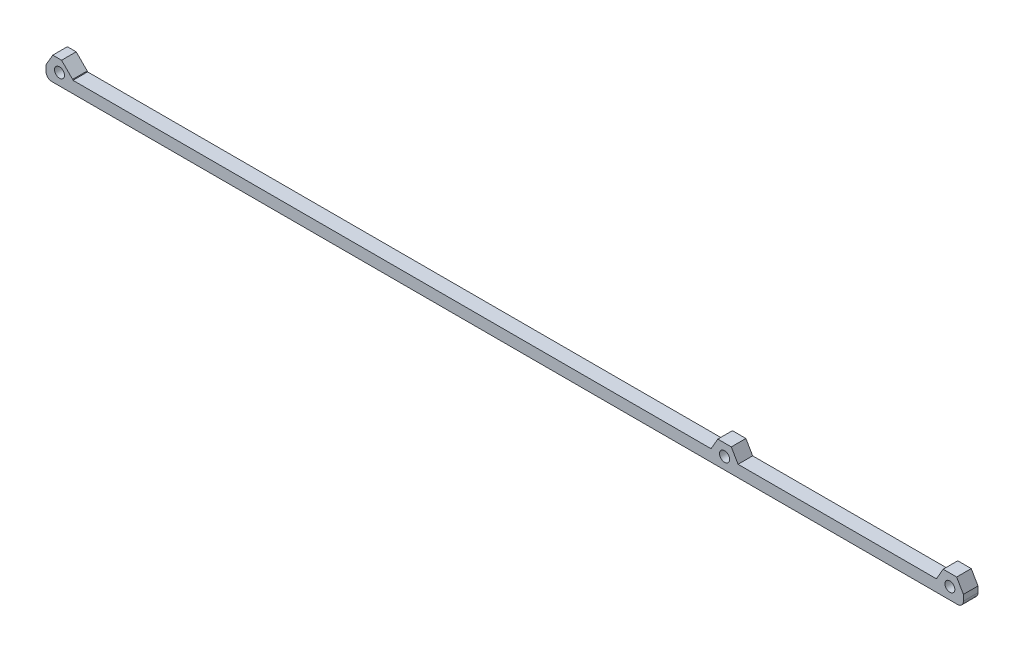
from build123d import *

# Parameters (mm, degrees)
SKETCH1_W           = 398.78
SKETCH1_H           = 5.08
BOSS_EXTRUDE1_DEPTH = 6.35
FILLET1_R           = 2.54
BOSS_EXTRUDE2_DEPTH = 6.35
SKETCH3_R           = 2.2
CUT_EXTRUDE1_DEPTH  = 399.959943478
BOSS_EXTRUDE3_DEPTH = 6.35
SKETCH5_R           = 2.15
CUT_EXTRUDE2_DEPTH  = 6.35
CHAMFER1_SIZE       = 2.032
CHAMFER1_SIZE2      = 5.551527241


with BuildPart() as part:
    # Sketch1 → Boss-Extrude1 (new body)
    with BuildSketch(Plane.XY):
        with Locations((199.39, 2.54)):
            Rectangle(SKETCH1_W, SKETCH1_H)
    extrude(amount=BOSS_EXTRUDE1_DEPTH)

    # Fillet1
    fillet1_edges = [part.edges().sort_by_distance(p)[0] for p in [
        (398.78, 0, 3.175),
        (0, 0, 3.175),
    ]]
    fillet(fillet1_edges, radius=FILLET1_R)

    # Sketch2 → Boss-Extrude2 (add)
    with BuildSketch(Plane.XY.offset(6.35)):
        Polygon((297.892728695, 0), (300.825668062, 5.08), (297.892728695, 10.16), (292.02684996, 10.16), (289.093910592, 5.08), (292.02684996, 0), align=None)
    extrude(amount=-BOSS_EXTRUDE2_DEPTH)

    # Sketch3 → Cut-Extrude1 (cut, through all)
    with BuildSketch(Plane.XY.offset(6.35)):
        with Locations((294.959789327, 5.08)):
            Circle(SKETCH3_R)
    extrude(amount=-CUT_EXTRUDE1_DEPTH, mode=Mode.SUBTRACT)

    # Sketch4 → Boss-Extrude3 (add)
    with BuildSketch(Plane.XY.offset(6.35)):
        Polygon((389.981181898, 0), (395.847060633, 0), (398.78, 5.08), (395.847060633, 10.16), (389.981181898, 10.16), (387.04824253, 5.08), align=None)
        Polygon((8.798818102, 0), (11.73175747, 5.08), (8.798818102, 10.16), (2.932939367, 10.16), (0, 5.08), (2.932939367, 0), align=None)
    extrude(amount=-BOSS_EXTRUDE3_DEPTH)

    # Sketch5 → Cut-Extrude2 (cut)
    with BuildSketch(Plane.XY.offset(6.35)):
        with Locations((392.914121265, 5.08)):
            Circle(SKETCH5_R)
        with Locations((5.865878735, 5.08)):
            Circle(SKETCH5_R)
    extrude(amount=-CUT_EXTRUDE2_DEPTH, mode=Mode.SUBTRACT)

    # Chamfer1
    chamfer1_edges = [part.edges().sort_by_distance(p)[0] for p in [
        (8.798818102, 10.16, 3.175),
    ]]
    chamfer1_side = [part.faces().sort_by_distance(p)[0] for p in [
        (5.865878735, 10.16, 3.175),
    ]]
    chamfer(chamfer1_edges, length=CHAMFER1_SIZE, length2=CHAMFER1_SIZE2, reference=chamfer1_side[0])


solid = part.part
